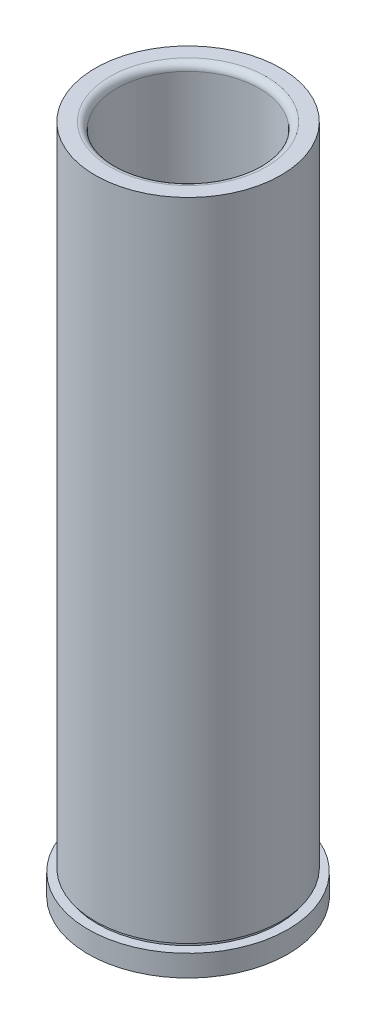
ISO-10303-21;
HEADER;
FILE_DESCRIPTION(('STEP AP214'),'2;1');
FILE_NAME('part.step','',(''),(''),'','','');
FILE_SCHEMA(('AUTOMOTIVE_DESIGN { 1 0 10303 214 1 1 1 1 }'));
ENDSEC;
DATA;
#1=APPLICATION_CONTEXT('core data for automotive mechanical design processes');
#2=APPLICATION_PROTOCOL_DEFINITION('international standard','automotive_design',2000,#1);
#3=PRODUCT_CONTEXT('',#1,'mechanical');
#4=PRODUCT('Part','Part','',(#3));
#5=PRODUCT_RELATED_PRODUCT_CATEGORY('part','',(#4));
#6=PRODUCT_DEFINITION_FORMATION('','',#4);
#7=PRODUCT_DEFINITION_CONTEXT('part definition',#1,'design');
#8=PRODUCT_DEFINITION('design','',#6,#7);
#9=PRODUCT_DEFINITION_SHAPE('','',#8);
#10=(LENGTH_UNIT() NAMED_UNIT(*) SI_UNIT(.MILLI.,.METRE.));
#11=(NAMED_UNIT(*) PLANE_ANGLE_UNIT() SI_UNIT($,.RADIAN.));
#12=(NAMED_UNIT(*) SI_UNIT($,.STERADIAN.) SOLID_ANGLE_UNIT());
#13=UNCERTAINTY_MEASURE_WITH_UNIT(LENGTH_MEASURE(1.E-05),#10,'distance_accuracy_value','');
#14=(GEOMETRIC_REPRESENTATION_CONTEXT(3) GLOBAL_UNCERTAINTY_ASSIGNED_CONTEXT((#13)) GLOBAL_UNIT_ASSIGNED_CONTEXT((#10,
#11,#12)) REPRESENTATION_CONTEXT('',''));
#15=CARTESIAN_POINT('',(0.,0.,0.));
#16=DIRECTION('',(0.,0.,1.));
#17=DIRECTION('',(1.,0.,0.));
#18=AXIS2_PLACEMENT_3D('',#15,#16,#17);
#19=CARTESIAN_POINT('',(-20.64385,149.225,0.));
#20=DIRECTION('',(0.,-1.,0.));
#21=DIRECTION('',(1.,0.,0.));
#22=AXIS2_PLACEMENT_3D('',#19,#20,#21);
#23=PLANE('',#22);
#24=CARTESIAN_POINT('',(-5.21016604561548E-13,149.225,0.));
#25=DIRECTION('',(0.,-1.,0.));
#26=DIRECTION('',(1.,0.,0.));
#27=AXIS2_PLACEMENT_3D('',#24,#25,#26);
#28=CIRCLE('',#27,17.4053499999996);
#29=CARTESIAN_POINT('',(17.4053499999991,149.225,0.));
#30=VERTEX_POINT('',#29);
#31=EDGE_CURVE('E36',#30,#30,#28,.T.);
#32=ORIENTED_EDGE('',*,*,#31,.T.);
#33=EDGE_LOOP('',(#32));
#34=FACE_BOUND('',#33,.T.);
#35=CARTESIAN_POINT('',(-5.21016604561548E-13,149.225,0.));
#36=DIRECTION('',(0.,-1.,0.));
#37=DIRECTION('',(1.,0.,0.));
#38=AXIS2_PLACEMENT_3D('',#35,#36,#37);
#39=CIRCLE('',#38,20.6438499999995);
#40=CARTESIAN_POINT('',(20.643849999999,149.225,0.));
#41=VERTEX_POINT('',#40);
#42=EDGE_CURVE('E40',#41,#41,#39,.T.);
#43=ORIENTED_EDGE('',*,*,#42,.F.);
#44=EDGE_LOOP('',(#43));
#45=FACE_BOUND('',#44,.T.);
#46=ADVANCED_FACE('F29',(#34,#45),#23,.F.);
#47=CARTESIAN_POINT('',(3.49148336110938E-12,-1000.,0.));
#48=DIRECTION('',(0.,-1.,0.));
#49=DIRECTION('',(1.,0.,0.));
#50=AXIS2_PLACEMENT_3D('',#47,#48,#49);
#51=CYLINDRICAL_SURFACE('',#50,20.6438499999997);
#52=CARTESIAN_POINT('',(0.,5.52449999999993,0.));
#53=DIRECTION('',(0.,-1.,0.));
#54=DIRECTION('',(1.,0.,0.));
#55=AXIS2_PLACEMENT_3D('',#52,#53,#54);
#56=CIRCLE('',#55,20.64385);
#57=CARTESIAN_POINT('',(20.6438499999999,5.5245,0.));
#58=VERTEX_POINT('',#57);
#59=EDGE_CURVE('E44',#58,#58,#56,.T.);
#60=ORIENTED_EDGE('',*,*,#59,.F.);
#61=EDGE_LOOP('',(#60));
#62=FACE_BOUND('',#61,.T.);
#63=ORIENTED_EDGE('',*,*,#42,.T.);
#64=EDGE_LOOP('',(#63));
#65=FACE_BOUND('',#64,.T.);
#66=ADVANCED_FACE('F121',(#62,#65),#51,.T.);
#67=CARTESIAN_POINT('',(-20.64385,5.52450000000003,0.));
#68=DIRECTION('',(0.,1.,0.));
#69=DIRECTION('',(-1.,0.,0.));
#70=AXIS2_PLACEMENT_3D('',#67,#68,#69);
#71=PLANE('',#70);
#72=CARTESIAN_POINT('',(0.,5.52449999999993,0.));
#73=DIRECTION('',(0.,-1.,0.));
#74=DIRECTION('',(1.,0.,0.));
#75=AXIS2_PLACEMENT_3D('',#72,#73,#74);
#76=CIRCLE('',#75,20.13585);
#77=CARTESIAN_POINT('',(20.1358499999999,5.5245,0.));
#78=VERTEX_POINT('',#77);
#79=EDGE_CURVE('E49',#78,#78,#76,.T.);
#80=ORIENTED_EDGE('',*,*,#79,.F.);
#81=EDGE_LOOP('',(#80));
#82=FACE_BOUND('',#81,.T.);
#83=ORIENTED_EDGE('',*,*,#59,.T.);
#84=EDGE_LOOP('',(#83));
#85=FACE_BOUND('',#84,.T.);
#86=ADVANCED_FACE('F115',(#82,#85),#71,.F.);
#87=CARTESIAN_POINT('',(3.49148336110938E-12,-1000.,0.));
#88=DIRECTION('',(0.,-1.,0.));
#89=DIRECTION('',(1.,0.,0.));
#90=AXIS2_PLACEMENT_3D('',#87,#88,#89);
#91=CYLINDRICAL_SURFACE('',#90,20.13585);
#92=CARTESIAN_POINT('',(0.,4.7625,0.));
#93=DIRECTION('',(0.,-1.,0.));
#94=DIRECTION('',(1.,0.,0.));
#95=AXIS2_PLACEMENT_3D('',#92,#93,#94);
#96=CIRCLE('',#95,20.13585);
#97=CARTESIAN_POINT('',(20.1358499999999,4.76250000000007,0.));
#98=VERTEX_POINT('',#97);
#99=EDGE_CURVE('E52',#98,#98,#96,.T.);
#100=ORIENTED_EDGE('',*,*,#99,.F.);
#101=EDGE_LOOP('',(#100));
#102=FACE_BOUND('',#101,.T.);
#103=ORIENTED_EDGE('',*,*,#79,.T.);
#104=EDGE_LOOP('',(#103));
#105=FACE_BOUND('',#104,.T.);
#106=ADVANCED_FACE('F109',(#102,#105),#91,.T.);
#107=CARTESIAN_POINT('',(-22.225,4.76250000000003,0.));
#108=DIRECTION('',(0.,-1.,0.));
#109=DIRECTION('',(1.,0.,0.));
#110=AXIS2_PLACEMENT_3D('',#107,#108,#109);
#111=PLANE('',#110);
#112=CARTESIAN_POINT('',(0.,4.7625,0.));
#113=DIRECTION('',(0.,-1.,0.));
#114=DIRECTION('',(1.,0.,0.));
#115=AXIS2_PLACEMENT_3D('',#112,#113,#114);
#116=CIRCLE('',#115,22.225);
#117=CARTESIAN_POINT('',(22.225,4.76250000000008,0.));
#118=VERTEX_POINT('',#117);
#119=EDGE_CURVE('E55',#118,#118,#116,.T.);
#120=ORIENTED_EDGE('',*,*,#119,.F.);
#121=EDGE_LOOP('',(#120));
#122=FACE_BOUND('',#121,.T.);
#123=ORIENTED_EDGE('',*,*,#99,.T.);
#124=EDGE_LOOP('',(#123));
#125=FACE_BOUND('',#124,.T.);
#126=ADVANCED_FACE('F103',(#122,#125),#111,.F.);
#127=CARTESIAN_POINT('',(3.49148336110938E-12,-1000.,0.));
#128=DIRECTION('',(0.,-1.,0.));
#129=DIRECTION('',(1.,0.,0.));
#130=AXIS2_PLACEMENT_3D('',#127,#128,#129);
#131=CYLINDRICAL_SURFACE('',#130,22.225);
#132=CARTESIAN_POINT('',(0.,0.,0.));
#133=DIRECTION('',(0.,-1.,0.));
#134=DIRECTION('',(1.,0.,0.));
#135=AXIS2_PLACEMENT_3D('',#132,#133,#134);
#136=CIRCLE('',#135,22.225);
#137=CARTESIAN_POINT('',(22.225,0.,0.));
#138=VERTEX_POINT('',#137);
#139=EDGE_CURVE('E58',#138,#138,#136,.T.);
#140=ORIENTED_EDGE('',*,*,#139,.F.);
#141=EDGE_LOOP('',(#140));
#142=FACE_BOUND('',#141,.T.);
#143=ORIENTED_EDGE('',*,*,#119,.T.);
#144=EDGE_LOOP('',(#143));
#145=FACE_BOUND('',#144,.T.);
#146=ADVANCED_FACE('F97',(#142,#145),#131,.T.);
#147=CARTESIAN_POINT('',(-17.9451,0.,0.));
#148=DIRECTION('',(0.,1.,0.));
#149=DIRECTION('',(-1.,0.,0.));
#150=AXIS2_PLACEMENT_3D('',#147,#148,#149);
#151=PLANE('',#150);
#152=CARTESIAN_POINT('',(0.,0.,0.));
#153=DIRECTION('',(0.,-1.,0.));
#154=DIRECTION('',(1.,0.,0.));
#155=AXIS2_PLACEMENT_3D('',#152,#153,#154);
#156=CIRCLE('',#155,17.9451);
#157=CARTESIAN_POINT('',(17.9451,0.,0.));
#158=VERTEX_POINT('',#157);
#159=EDGE_CURVE('E61',#158,#158,#156,.T.);
#160=ORIENTED_EDGE('',*,*,#159,.F.);
#161=EDGE_LOOP('',(#160));
#162=FACE_BOUND('',#161,.T.);
#163=ORIENTED_EDGE('',*,*,#139,.T.);
#164=EDGE_LOOP('',(#163));
#165=FACE_BOUND('',#164,.T.);
#166=ADVANCED_FACE('F91',(#162,#165),#151,.F.);
#167=CARTESIAN_POINT('',(0.,0.,0.));
#168=DIRECTION('',(0.,-1.,0.));
#169=DIRECTION('',(1.,0.,0.));
#170=AXIS2_PLACEMENT_3D('',#167,#168,#169);
#171=CONICAL_SURFACE('',#170,17.9451,0.785398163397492);
#172=CARTESIAN_POINT('',(0.,0.793749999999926,0.));
#173=DIRECTION('',(0.,-1.,0.));
#174=DIRECTION('',(1.,0.,0.));
#175=AXIS2_PLACEMENT_3D('',#172,#173,#174);
#176=CIRCLE('',#175,17.15135);
#177=CARTESIAN_POINT('',(17.15135,0.793749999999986,0.));
#178=VERTEX_POINT('',#177);
#179=EDGE_CURVE('E64',#178,#178,#176,.T.);
#180=ORIENTED_EDGE('',*,*,#179,.F.);
#181=EDGE_LOOP('',(#180));
#182=FACE_BOUND('',#181,.T.);
#183=ORIENTED_EDGE('',*,*,#159,.T.);
#184=EDGE_LOOP('',(#183));
#185=FACE_BOUND('',#184,.T.);
#186=ADVANCED_FACE('F85',(#182,#185),#171,.F.);
#187=CARTESIAN_POINT('',(3.49148336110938E-12,-1000.,0.));
#188=DIRECTION('',(0.,-1.,0.));
#189=DIRECTION('',(1.,0.,0.));
#190=AXIS2_PLACEMENT_3D('',#187,#188,#189);
#191=CYLINDRICAL_SURFACE('',#190,17.1513499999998);
#192=CARTESIAN_POINT('',(-2.94873227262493E-13,84.4550000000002,0.));
#193=DIRECTION('',(0.,-1.,0.));
#194=DIRECTION('',(1.,0.,0.));
#195=AXIS2_PLACEMENT_3D('',#192,#193,#194);
#196=CIRCLE('',#195,17.1513499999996);
#197=CARTESIAN_POINT('',(17.1513499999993,84.4550000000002,0.));
#198=VERTEX_POINT('',#197);
#199=EDGE_CURVE('E67',#198,#198,#196,.T.);
#200=ORIENTED_EDGE('',*,*,#199,.F.);
#201=EDGE_LOOP('',(#200));
#202=FACE_BOUND('',#201,.T.);
#203=ORIENTED_EDGE('',*,*,#179,.T.);
#204=EDGE_LOOP('',(#203));
#205=FACE_BOUND('',#204,.T.);
#206=ADVANCED_FACE('F79',(#202,#205),#191,.F.);
#207=CARTESIAN_POINT('',(-2.94902990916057E-13,84.4550000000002,0.));
#208=DIRECTION('',(0.,-1.,0.));
#209=DIRECTION('',(1.,0.,0.));
#210=AXIS2_PLACEMENT_3D('',#207,#208,#209);
#211=TOROIDAL_SURFACE('',#210,15.8813499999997,1.26999999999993);
#212=CARTESIAN_POINT('',(-2.99307411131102E-13,85.7250000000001,0.));
#213=DIRECTION('',(0.,-1.,0.));
#214=DIRECTION('',(1.,0.,0.));
#215=AXIS2_PLACEMENT_3D('',#212,#213,#214);
#216=CIRCLE('',#215,15.8813499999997);
#217=CARTESIAN_POINT('',(15.8813499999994,85.7250000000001,0.));
#218=VERTEX_POINT('',#217);
#219=EDGE_CURVE('E70',#218,#218,#216,.T.);
#220=ORIENTED_EDGE('',*,*,#219,.F.);
#221=EDGE_LOOP('',(#220));
#222=FACE_BOUND('',#221,.T.);
#223=ORIENTED_EDGE('',*,*,#199,.T.);
#224=EDGE_LOOP('',(#223));
#225=FACE_BOUND('',#224,.T.);
#226=ADVANCED_FACE('F76',(#222,#225),#211,.F.);
#227=CARTESIAN_POINT('',(3.49148336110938E-12,-1000.,0.));
#228=DIRECTION('',(0.,-1.,0.));
#229=DIRECTION('',(1.,0.,0.));
#230=AXIS2_PLACEMENT_3D('',#227,#228,#229);
#231=CYLINDRICAL_SURFACE('',#230,15.8813499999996);
#232=CARTESIAN_POINT('',(-5.15695583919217E-13,147.701,0.));
#233=DIRECTION('',(0.,-1.,0.));
#234=DIRECTION('',(1.,0.,0.));
#235=AXIS2_PLACEMENT_3D('',#232,#233,#234);
#236=CIRCLE('',#235,15.8813499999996);
#237=CARTESIAN_POINT('',(15.8813499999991,147.701,0.));
#238=VERTEX_POINT('',#237);
#239=EDGE_CURVE('E10',#238,#238,#236,.F.);
#240=ORIENTED_EDGE('',*,*,#239,.T.);
#241=EDGE_LOOP('',(#240));
#242=FACE_BOUND('',#241,.T.);
#243=ORIENTED_EDGE('',*,*,#219,.T.);
#244=EDGE_LOOP('',(#243));
#245=FACE_BOUND('',#244,.T.);
#246=ADVANCED_FACE('F74',(#242,#245),#231,.F.);
#247=CARTESIAN_POINT('',(-5.15695583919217E-13,147.701,0.));
#248=DIRECTION('',(0.,-1.,0.));
#249=DIRECTION('',(1.,0.,0.));
#250=AXIS2_PLACEMENT_3D('',#247,#248,#249);
#251=TOROIDAL_SURFACE('',#250,17.4053499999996,1.524);
#252=ORIENTED_EDGE('',*,*,#239,.F.);
#253=EDGE_LOOP('',(#252));
#254=FACE_BOUND('',#253,.T.);
#255=ORIENTED_EDGE('',*,*,#31,.F.);
#256=EDGE_LOOP('',(#255));
#257=FACE_BOUND('',#256,.T.);
#258=ADVANCED_FACE('F31',(#254,#257),#251,.T.);
#259=CLOSED_SHELL('',(#46,#66,#86,#106,#126,#146,#166,#186,#206,#226,#246,#258));
#260=MANIFOLD_SOLID_BREP('B2',#259);
#261=ADVANCED_BREP_SHAPE_REPRESENTATION('',(#18,#260),#14);
#262=SHAPE_DEFINITION_REPRESENTATION(#9,#261);
ENDSEC;
END-ISO-10303-21;
